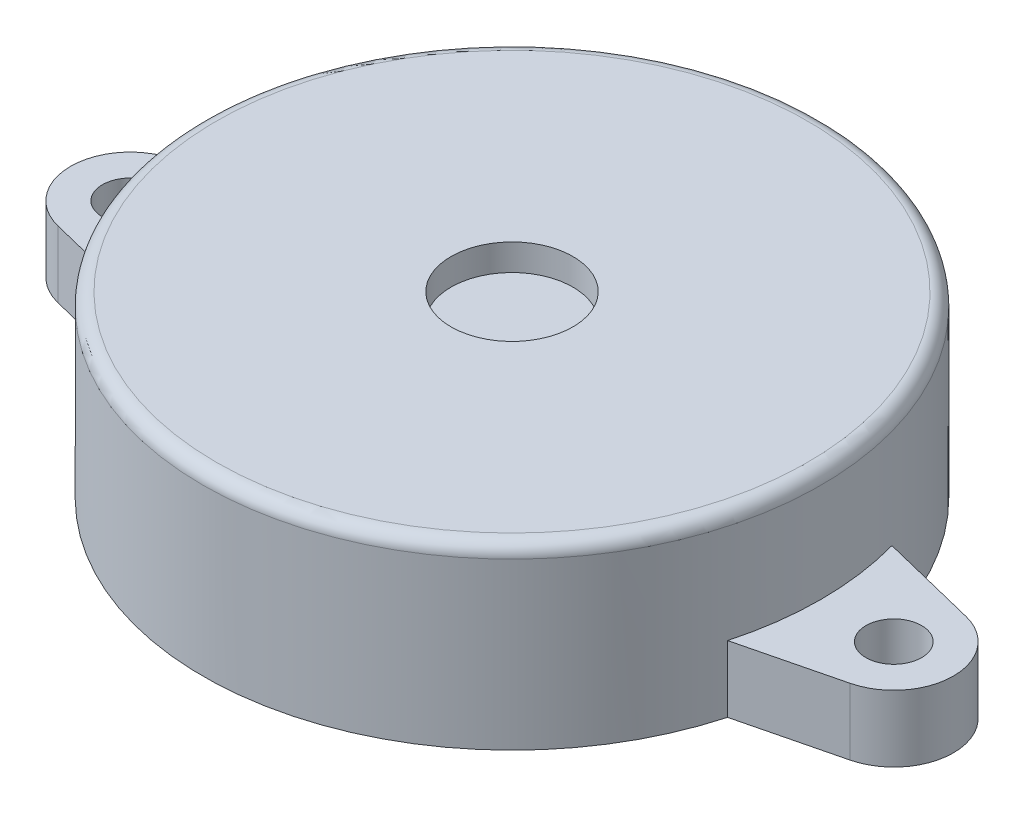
from build123d import *

# Parameters (mm, degrees)
ESQUISSE1_R             = 11.65
BOSS_EXTRU_1_DEPTH      = 4.23
BOSS_EXTRU_2_START      = 2.51
ESQUISSE2_R             = 1.05
BOSS_EXTRU_2_DEPTH      = 2.51
ESQUISSE3_R             = 2.3
ENL_V_MAT_EXTRU_1_DEPTH = 1
CONG_1_R                = 0.5


with BuildPart() as part:
    # Esquisse1 → Boss.-Extru.1 (new body)
    with BuildSketch(Plane(origin=(0, 0, 0), x_dir=(1, 0, 0), z_dir=(0, 1, 0))):
        with Locations(Location((0, 0, 0), (0, 0, 270))):
            Circle(ESQUISSE1_R)
    extrude(amount=BOSS_EXTRU_1_DEPTH)

    # Esquisse2 → Boss.-Extru.2 (add)
    with BuildSketch(Plane.XZ.offset(BOSS_EXTRU_2_START)):
        with BuildLine():
            Line((11.229982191, 3.1), (14.9391949, 2.184437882))
            ThreePointArc((14.9391949, 2.184437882), (16.65, 0), (14.9391949, -2.184437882))
            Line((14.9391949, -2.184437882), (11.229982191, -3.1))
            ThreePointArc((11.229982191, -3.1), (0, -11.65), (-11.229982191, -3.1))
            Line((-11.229982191, -3.1), (-14.9391949, -2.184437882))
            ThreePointArc((-14.9391949, -2.184437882), (-16.65, 0), (-14.9391949, 2.184437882))
            Line((-14.9391949, 2.184437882), (-11.229982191, 3.1))
            ThreePointArc((-11.229982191, 3.1), (0, 11.65), (11.229982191, 3.1))
        make_face()
        with Locations(Location((14.4, 0, 0), (0, 0, 270))):
            Circle(ESQUISSE2_R, mode=Mode.SUBTRACT)
        with Locations(Location((-14.4, 0, 0), (0, 0, 90))):
            Circle(ESQUISSE2_R, mode=Mode.SUBTRACT)
    extrude(amount=-BOSS_EXTRU_2_DEPTH)

    # Esquisse3 → Enl_v. mat.-Extru.1 (cut)
    with BuildSketch(Plane(origin=(0, 4.23, 0), x_dir=(1, 0, 0), z_dir=(0, 1, 0))):
        with Locations(Location((0, 0, 0), (0, 0, 270))):
            Circle(ESQUISSE3_R)
    extrude(amount=-ENL_V_MAT_EXTRU_1_DEPTH, mode=Mode.SUBTRACT)

    # Cong_1
    cong_1_edges = [part.edges().sort_by_distance(p)[0] for p in [
        (0, 4.23, -11.65),
    ]]
    fillet(cong_1_edges, radius=CONG_1_R)


solid = part.part
